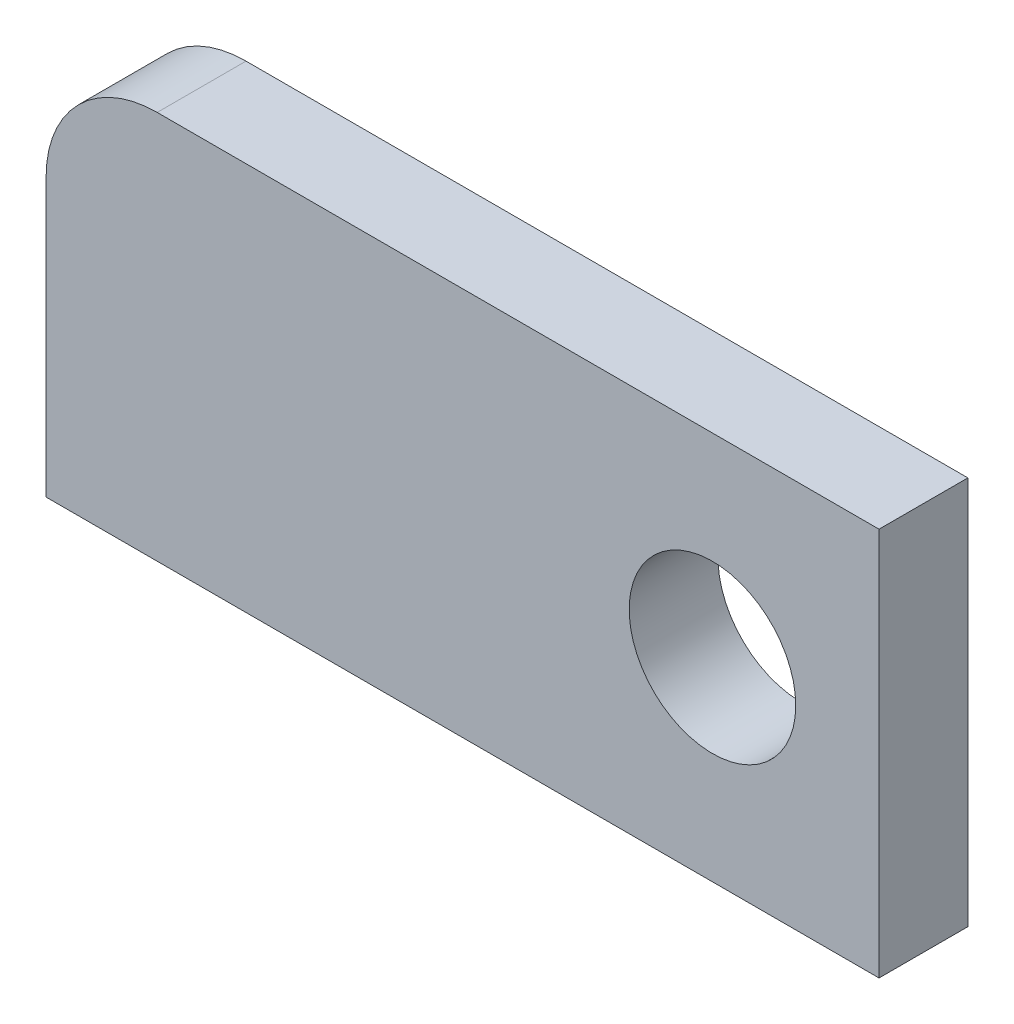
from build123d import *

# Parameters (mm, degrees)
ESQUISSE1_R      = 7.5
EXTRUSION1_DEPTH = 8


with BuildPart() as part:
    # Esquisse1 → Extrusion1 (new body)
    with BuildSketch(Plane.XY):
        with BuildLine():
            Line((0, 0), (75, 0))
            Line((75, 0), (75, 35))
            Line((75, 35), (10, 35))
            ThreePointArc((10, 35), (2.928932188, 32.071067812), (0, 25))
            Line((0, 25), (0, 0))
        make_face()
        with Locations((60, 17.5)):
            Circle(ESQUISSE1_R, mode=Mode.SUBTRACT)
    extrude(amount=EXTRUSION1_DEPTH)


solid = part.part
